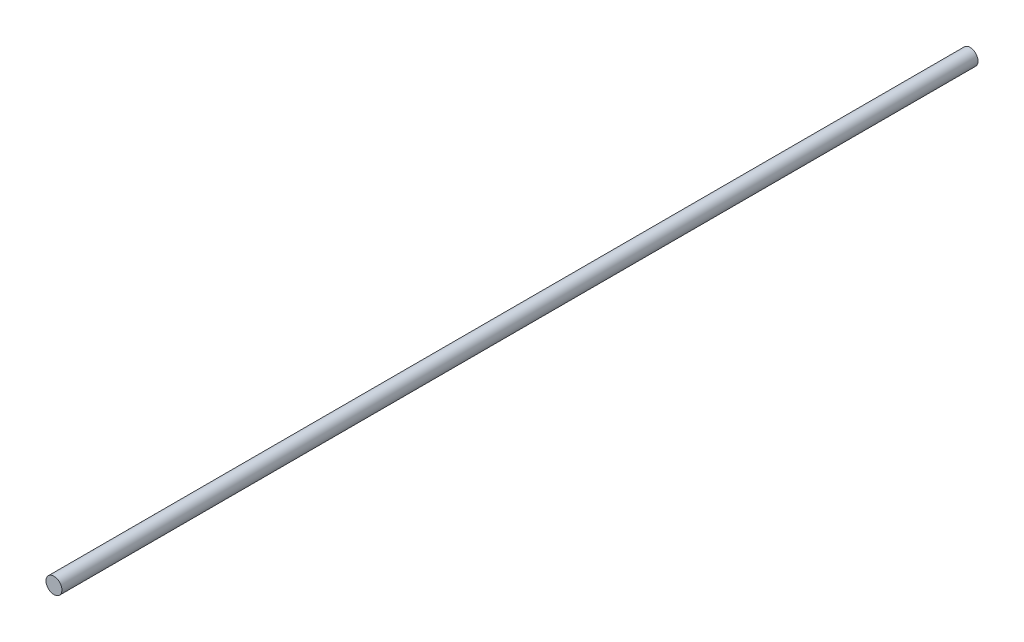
ISO-10303-21;
HEADER;
FILE_DESCRIPTION(('STEP AP214'),'2;1');
FILE_NAME('part.step','',(''),(''),'','','');
FILE_SCHEMA(('AUTOMOTIVE_DESIGN { 1 0 10303 214 1 1 1 1 }'));
ENDSEC;
DATA;
#1=APPLICATION_CONTEXT('core data for automotive mechanical design processes');
#2=APPLICATION_PROTOCOL_DEFINITION('international standard','automotive_design',2000,#1);
#3=PRODUCT_CONTEXT('',#1,'mechanical');
#4=PRODUCT('Part','Part','',(#3));
#5=PRODUCT_RELATED_PRODUCT_CATEGORY('part','',(#4));
#6=PRODUCT_DEFINITION_FORMATION('','',#4);
#7=PRODUCT_DEFINITION_CONTEXT('part definition',#1,'design');
#8=PRODUCT_DEFINITION('design','',#6,#7);
#9=PRODUCT_DEFINITION_SHAPE('','',#8);
#10=(LENGTH_UNIT() NAMED_UNIT(*) SI_UNIT(.MILLI.,.METRE.));
#11=(NAMED_UNIT(*) PLANE_ANGLE_UNIT() SI_UNIT($,.RADIAN.));
#12=(NAMED_UNIT(*) SI_UNIT($,.STERADIAN.) SOLID_ANGLE_UNIT());
#13=UNCERTAINTY_MEASURE_WITH_UNIT(LENGTH_MEASURE(1.E-05),#10,'distance_accuracy_value','');
#14=(GEOMETRIC_REPRESENTATION_CONTEXT(3) GLOBAL_UNCERTAINTY_ASSIGNED_CONTEXT((#13)) GLOBAL_UNIT_ASSIGNED_CONTEXT((#10,
#11,#12)) REPRESENTATION_CONTEXT('',''));
#15=CARTESIAN_POINT('',(0.,0.,0.));
#16=DIRECTION('',(0.,0.,1.));
#17=DIRECTION('',(1.,0.,0.));
#18=AXIS2_PLACEMENT_3D('',#15,#16,#17);
#19=CARTESIAN_POINT('',(0.,0.,-3450.));
#20=DIRECTION('',(0.,0.,1.));
#21=DIRECTION('',(1.,0.,0.));
#22=AXIS2_PLACEMENT_3D('',#19,#20,#21);
#23=CYLINDRICAL_SURFACE('',#22,30.);
#24=CARTESIAN_POINT('',(0.,0.,-3450.));
#25=DIRECTION('',(0.,0.,1.));
#26=DIRECTION('',(1.,0.,0.));
#27=AXIS2_PLACEMENT_3D('',#24,#25,#26);
#28=CIRCLE('',#27,30.);
#29=CARTESIAN_POINT('',(30.,0.,-3450.));
#30=VERTEX_POINT('',#29);
#31=EDGE_CURVE('E10',#30,#30,#28,.T.);
#32=ORIENTED_EDGE('',*,*,#31,.T.);
#33=EDGE_LOOP('',(#32));
#34=FACE_BOUND('',#33,.T.);
#35=CARTESIAN_POINT('',(0.,0.,0.));
#36=DIRECTION('',(0.,0.,1.));
#37=DIRECTION('',(1.,0.,0.));
#38=AXIS2_PLACEMENT_3D('',#35,#36,#37);
#39=CIRCLE('',#38,30.);
#40=CARTESIAN_POINT('',(30.,0.,0.));
#41=VERTEX_POINT('',#40);
#42=EDGE_CURVE('E40',#41,#41,#39,.T.);
#43=ORIENTED_EDGE('',*,*,#42,.F.);
#44=EDGE_LOOP('',(#43));
#45=FACE_BOUND('',#44,.T.);
#46=ADVANCED_FACE('F37',(#34,#45),#23,.T.);
#47=CARTESIAN_POINT('',(0.,0.,-3450.));
#48=DIRECTION('',(0.,0.,1.));
#49=DIRECTION('',(1.,0.,0.));
#50=AXIS2_PLACEMENT_3D('',#47,#48,#49);
#51=PLANE('',#50);
#52=ORIENTED_EDGE('',*,*,#31,.F.);
#53=EDGE_LOOP('',(#52));
#54=FACE_BOUND('',#53,.T.);
#55=ADVANCED_FACE('F54',(#54),#51,.F.);
#56=CARTESIAN_POINT('',(0.,0.,0.));
#57=DIRECTION('',(0.,0.,1.));
#58=DIRECTION('',(1.,0.,0.));
#59=AXIS2_PLACEMENT_3D('',#56,#57,#58);
#60=PLANE('',#59);
#61=ORIENTED_EDGE('',*,*,#42,.T.);
#62=EDGE_LOOP('',(#61));
#63=FACE_BOUND('',#62,.T.);
#64=ADVANCED_FACE('F51',(#63),#60,.T.);
#65=CLOSED_SHELL('',(#46,#55,#64));
#66=MANIFOLD_SOLID_BREP('B2',#65);
#67=ADVANCED_BREP_SHAPE_REPRESENTATION('',(#18,#66),#14);
#68=SHAPE_DEFINITION_REPRESENTATION(#9,#67);
ENDSEC;
END-ISO-10303-21;
